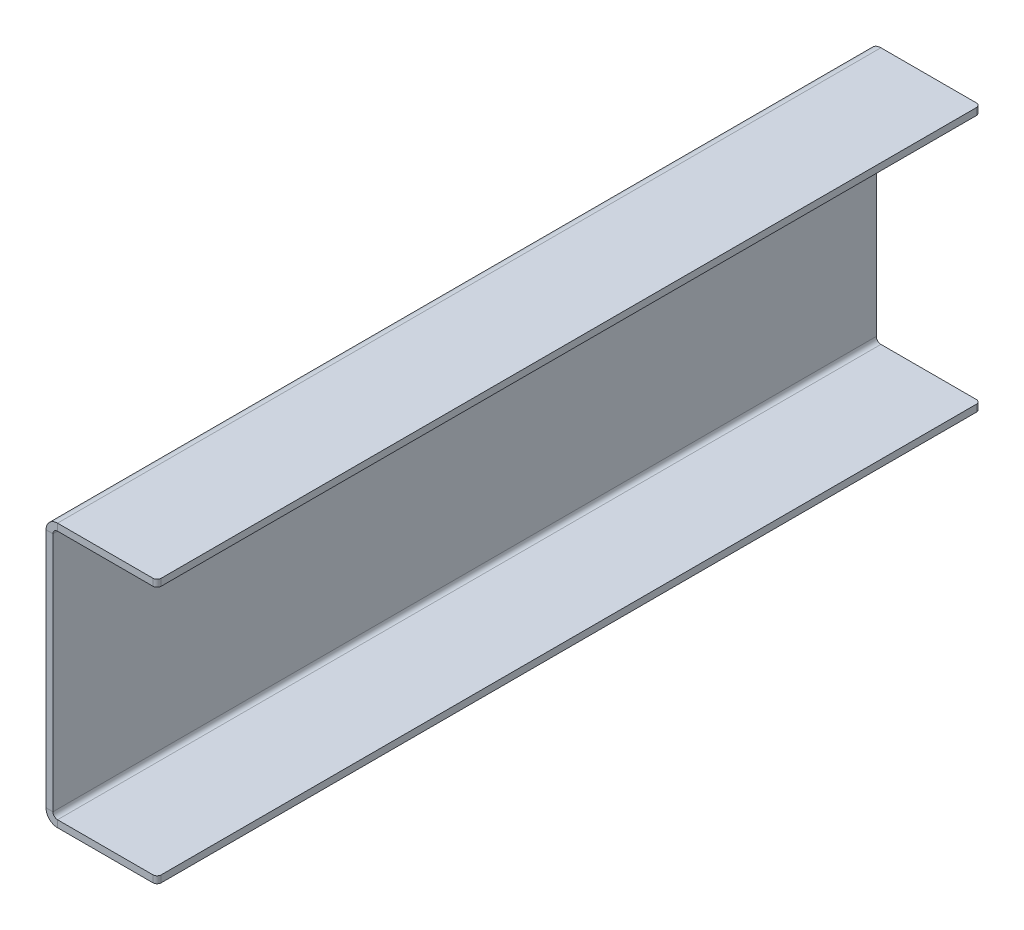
ISO-10303-21;
HEADER;
FILE_DESCRIPTION(('STEP AP214'),'2;1');
FILE_NAME('part.step','',(''),(''),'','','');
FILE_SCHEMA(('AUTOMOTIVE_DESIGN { 1 0 10303 214 1 1 1 1 }'));
ENDSEC;
DATA;
#1=APPLICATION_CONTEXT('core data for automotive mechanical design processes');
#2=APPLICATION_PROTOCOL_DEFINITION('international standard','automotive_design',2000,#1);
#3=PRODUCT_CONTEXT('',#1,'mechanical');
#4=PRODUCT('Part','Part','',(#3));
#5=PRODUCT_RELATED_PRODUCT_CATEGORY('part','',(#4));
#6=PRODUCT_DEFINITION_FORMATION('','',#4);
#7=PRODUCT_DEFINITION_CONTEXT('part definition',#1,'design');
#8=PRODUCT_DEFINITION('design','',#6,#7);
#9=PRODUCT_DEFINITION_SHAPE('','',#8);
#10=(LENGTH_UNIT() NAMED_UNIT(*) SI_UNIT(.MILLI.,.METRE.));
#11=(NAMED_UNIT(*) PLANE_ANGLE_UNIT() SI_UNIT($,.RADIAN.));
#12=(NAMED_UNIT(*) SI_UNIT($,.STERADIAN.) SOLID_ANGLE_UNIT());
#13=UNCERTAINTY_MEASURE_WITH_UNIT(LENGTH_MEASURE(1.E-05),#10,'distance_accuracy_value','');
#14=(GEOMETRIC_REPRESENTATION_CONTEXT(3) GLOBAL_UNCERTAINTY_ASSIGNED_CONTEXT((#13)) GLOBAL_UNIT_ASSIGNED_CONTEXT((#10,
#11,#12)) REPRESENTATION_CONTEXT('',''));
#15=CARTESIAN_POINT('',(0.,0.,0.));
#16=DIRECTION('',(0.,0.,1.));
#17=DIRECTION('',(1.,0.,0.));
#18=AXIS2_PLACEMENT_3D('',#15,#16,#17);
#19=CARTESIAN_POINT('',(-5.,0.,0.));
#20=DIRECTION('',(1.,0.,0.));
#21=DIRECTION('',(0.,0.,-1.));
#22=AXIS2_PLACEMENT_3D('',#19,#20,#21);
#23=PLANE('',#22);
#24=DIRECTION('',(0.,0.,-1.));
#25=VECTOR('',#24,1.);
#26=CARTESIAN_POINT('',(-5.00000000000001,-86.6999999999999,-296.5));
#27=LINE('',#26,#25);
#28=CARTESIAN_POINT('',(-5.00000000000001,-86.6999999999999,-296.5));
#29=VERTEX_POINT('',#28);
#30=CARTESIAN_POINT('',(-5.,-86.7,296.5));
#31=VERTEX_POINT('',#30);
#32=EDGE_CURVE('E160',#29,#31,#27,.F.);
#33=ORIENTED_EDGE('',*,*,#32,.T.);
#34=DIRECTION('',(0.,-1.,0.));
#35=VECTOR('',#34,1.);
#36=CARTESIAN_POINT('',(-5.,-90.,296.5));
#37=LINE('',#36,#35);
#38=CARTESIAN_POINT('',(-5.00000000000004,86.6999999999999,296.5));
#39=VERTEX_POINT('',#38);
#40=EDGE_CURVE('E264',#39,#31,#37,.T.);
#41=ORIENTED_EDGE('',*,*,#40,.F.);
#42=DIRECTION('',(0.,0.,1.));
#43=VECTOR('',#42,1.);
#44=CARTESIAN_POINT('',(-5.00000000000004,86.6999999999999,296.5));
#45=LINE('',#44,#43);
#46=CARTESIAN_POINT('',(-5.,86.7,-296.5));
#47=VERTEX_POINT('',#46);
#48=EDGE_CURVE('E240',#39,#47,#45,.F.);
#49=ORIENTED_EDGE('',*,*,#48,.T.);
#50=DIRECTION('',(0.,1.,0.));
#51=VECTOR('',#50,1.);
#52=CARTESIAN_POINT('',(-5.,-89.9999999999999,-296.5));
#53=LINE('',#52,#51);
#54=EDGE_CURVE('E267',#29,#47,#53,.T.);
#55=ORIENTED_EDGE('',*,*,#54,.F.);
#56=EDGE_LOOP('',(#33,#41,#49,#55));
#57=FACE_BOUND('',#56,.T.);
#58=ADVANCED_FACE('F37',(#57),#23,.F.);
#59=CARTESIAN_POINT('',(0.,0.,0.));
#60=DIRECTION('',(1.,0.,0.));
#61=DIRECTION('',(0.,0.,-1.));
#62=AXIS2_PLACEMENT_3D('',#59,#60,#61);
#63=PLANE('',#62);
#64=DIRECTION('',(0.,-1.,0.));
#65=VECTOR('',#64,1.);
#66=CARTESIAN_POINT('',(0.,-90.,296.5));
#67=LINE('',#66,#65);
#68=CARTESIAN_POINT('',(0.,86.6999999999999,296.5));
#69=VERTEX_POINT('',#68);
#70=CARTESIAN_POINT('',(0.,-86.7,296.5));
#71=VERTEX_POINT('',#70);
#72=EDGE_CURVE('E261',#69,#71,#67,.T.);
#73=ORIENTED_EDGE('',*,*,#72,.T.);
#74=DIRECTION('',(0.,0.,-1.));
#75=VECTOR('',#74,1.);
#76=CARTESIAN_POINT('',(0.,-86.7,-296.5));
#77=LINE('',#76,#75);
#78=CARTESIAN_POINT('',(0.,-86.7,-296.5));
#79=VERTEX_POINT('',#78);
#80=EDGE_CURVE('E207',#79,#71,#77,.F.);
#81=ORIENTED_EDGE('',*,*,#80,.F.);
#82=DIRECTION('',(0.,1.,0.));
#83=VECTOR('',#82,1.);
#84=CARTESIAN_POINT('',(0.,-89.9999999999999,-296.5));
#85=LINE('',#84,#83);
#86=CARTESIAN_POINT('',(0.,86.7,-296.5));
#87=VERTEX_POINT('',#86);
#88=EDGE_CURVE('E268',#79,#87,#85,.T.);
#89=ORIENTED_EDGE('',*,*,#88,.T.);
#90=DIRECTION('',(0.,0.,1.));
#91=VECTOR('',#90,1.);
#92=CARTESIAN_POINT('',(0.,86.7,296.5));
#93=LINE('',#92,#91);
#94=EDGE_CURVE('E253',#69,#87,#93,.F.);
#95=ORIENTED_EDGE('',*,*,#94,.F.);
#96=EDGE_LOOP('',(#73,#81,#89,#95));
#97=FACE_BOUND('',#96,.T.);
#98=ADVANCED_FACE('F324',(#97),#63,.T.);
#99=CARTESIAN_POINT('',(-5.,-89.9999999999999,-296.5));
#100=DIRECTION('',(0.,0.,-1.));
#101=DIRECTION('',(-1.,0.,0.));
#102=AXIS2_PLACEMENT_3D('',#99,#100,#101);
#103=PLANE('',#102);
#104=ORIENTED_EDGE('',*,*,#88,.F.);
#105=DIRECTION('',(-1.,0.,0.));
#106=VECTOR('',#105,1.);
#107=CARTESIAN_POINT('',(0.,-86.7,-296.5));
#108=LINE('',#107,#106);
#109=EDGE_CURVE('E203',#79,#29,#108,.T.);
#110=ORIENTED_EDGE('',*,*,#109,.T.);
#111=ORIENTED_EDGE('',*,*,#54,.T.);
#112=DIRECTION('',(-1.,0.,0.));
#113=VECTOR('',#112,1.);
#114=CARTESIAN_POINT('',(0.,86.7,-296.5));
#115=LINE('',#114,#113);
#116=EDGE_CURVE('E258',#87,#47,#115,.T.);
#117=ORIENTED_EDGE('',*,*,#116,.F.);
#118=EDGE_LOOP('',(#104,#110,#111,#117));
#119=FACE_BOUND('',#118,.T.);
#120=ADVANCED_FACE('F328',(#119),#103,.T.);
#121=CARTESIAN_POINT('',(-5.,-90.,296.5));
#122=DIRECTION('',(0.,0.,1.));
#123=DIRECTION('',(1.,0.,0.));
#124=AXIS2_PLACEMENT_3D('',#121,#122,#123);
#125=PLANE('',#124);
#126=DIRECTION('',(-1.,0.,0.));
#127=VECTOR('',#126,1.);
#128=CARTESIAN_POINT('',(0.,-86.7,296.5));
#129=LINE('',#128,#127);
#130=EDGE_CURVE('E211',#71,#31,#129,.T.);
#131=ORIENTED_EDGE('',*,*,#130,.F.);
#132=ORIENTED_EDGE('',*,*,#72,.F.);
#133=DIRECTION('',(-1.,0.,0.));
#134=VECTOR('',#133,1.);
#135=CARTESIAN_POINT('',(0.,86.7,296.5));
#136=LINE('',#135,#134);
#137=EDGE_CURVE('E247',#69,#39,#136,.T.);
#138=ORIENTED_EDGE('',*,*,#137,.T.);
#139=ORIENTED_EDGE('',*,*,#40,.T.);
#140=EDGE_LOOP('',(#131,#132,#138,#139));
#141=FACE_BOUND('',#140,.T.);
#142=ADVANCED_FACE('F385',(#141),#125,.T.);
#143=CARTESIAN_POINT('',(3.3,86.7,-296.5));
#144=DIRECTION('',(0.,0.,-1.));
#145=DIRECTION('',(-1.,0.,0.));
#146=AXIS2_PLACEMENT_3D('',#143,#144,#145);
#147=PLANE('',#146);
#148=DIRECTION('',(0.,1.,0.));
#149=VECTOR('',#148,1.);
#150=CARTESIAN_POINT('',(3.29999999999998,90.0000000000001,-296.5));
#151=LINE('',#150,#149);
#152=CARTESIAN_POINT('',(3.29999999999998,90.0000000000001,-296.5));
#153=VERTEX_POINT('',#152);
#154=CARTESIAN_POINT('',(3.29999999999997,95.0000000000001,-296.5));
#155=VERTEX_POINT('',#154);
#156=EDGE_CURVE('E214',#153,#155,#151,.T.);
#157=ORIENTED_EDGE('',*,*,#156,.F.);
#158=CARTESIAN_POINT('',(3.3,86.7,-296.5));
#159=DIRECTION('',(0.,0.,1.));
#160=DIRECTION('',(1.,0.,0.));
#161=AXIS2_PLACEMENT_3D('',#158,#159,#160);
#162=CIRCLE('',#161,3.30000000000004);
#163=EDGE_CURVE('E250',#87,#153,#162,.F.);
#164=ORIENTED_EDGE('',*,*,#163,.F.);
#165=ORIENTED_EDGE('',*,*,#116,.T.);
#166=CARTESIAN_POINT('',(3.3,86.7,-296.5));
#167=DIRECTION('',(0.,0.,1.));
#168=DIRECTION('',(1.,0.,0.));
#169=AXIS2_PLACEMENT_3D('',#166,#167,#168);
#170=CIRCLE('',#169,8.30000000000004);
#171=EDGE_CURVE('E243',#47,#155,#170,.F.);
#172=ORIENTED_EDGE('',*,*,#171,.T.);
#173=EDGE_LOOP('',(#157,#164,#165,#172));
#174=FACE_BOUND('',#173,.T.);
#175=ADVANCED_FACE('F337',(#174),#147,.T.);
#176=CARTESIAN_POINT('',(3.3,86.7,296.5));
#177=DIRECTION('',(0.,0.,-1.));
#178=DIRECTION('',(-1.,0.,0.));
#179=AXIS2_PLACEMENT_3D('',#176,#177,#178);
#180=PLANE('',#179);
#181=CARTESIAN_POINT('',(3.3,86.7,296.5));
#182=DIRECTION('',(0.,0.,1.));
#183=DIRECTION('',(1.,0.,0.));
#184=AXIS2_PLACEMENT_3D('',#181,#182,#183);
#185=CIRCLE('',#184,3.30000000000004);
#186=CARTESIAN_POINT('',(3.29999999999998,90.0000000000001,296.5));
#187=VERTEX_POINT('',#186);
#188=EDGE_CURVE('E235',#187,#69,#185,.T.);
#189=ORIENTED_EDGE('',*,*,#188,.F.);
#190=DIRECTION('',(0.,1.,0.));
#191=VECTOR('',#190,1.);
#192=CARTESIAN_POINT('',(3.29999999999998,90.,296.5));
#193=LINE('',#192,#191);
#194=CARTESIAN_POINT('',(3.29999999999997,95.,296.5));
#195=VERTEX_POINT('',#194);
#196=EDGE_CURVE('E219',#187,#195,#193,.T.);
#197=ORIENTED_EDGE('',*,*,#196,.T.);
#198=CARTESIAN_POINT('',(3.3,86.7,296.5));
#199=DIRECTION('',(0.,0.,1.));
#200=DIRECTION('',(1.,0.,0.));
#201=AXIS2_PLACEMENT_3D('',#198,#199,#200);
#202=CIRCLE('',#201,8.30000000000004);
#203=EDGE_CURVE('E244',#195,#39,#202,.T.);
#204=ORIENTED_EDGE('',*,*,#203,.T.);
#205=ORIENTED_EDGE('',*,*,#137,.F.);
#206=EDGE_LOOP('',(#189,#197,#204,#205));
#207=FACE_BOUND('',#206,.T.);
#208=ADVANCED_FACE('F350',(#207),#180,.F.);
#209=CARTESIAN_POINT('',(3.3,86.7,296.5));
#210=DIRECTION('',(0.,0.,1.));
#211=DIRECTION('',(0.,1.,0.));
#212=AXIS2_PLACEMENT_3D('',#209,#210,#211);
#213=CYLINDRICAL_SURFACE('',#212,8.30000000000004);
#214=ORIENTED_EDGE('',*,*,#48,.F.);
#215=ORIENTED_EDGE('',*,*,#203,.F.);
#216=DIRECTION('',(0.,0.,-1.));
#217=VECTOR('',#216,1.);
#218=CARTESIAN_POINT('',(3.29999999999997,95.,0.));
#219=LINE('',#218,#217);
#220=EDGE_CURVE('E222',#195,#155,#219,.T.);
#221=ORIENTED_EDGE('',*,*,#220,.T.);
#222=ORIENTED_EDGE('',*,*,#171,.F.);
#223=EDGE_LOOP('',(#214,#215,#221,#222));
#224=FACE_BOUND('',#223,.T.);
#225=ADVANCED_FACE('F393',(#224),#213,.T.);
#226=CARTESIAN_POINT('',(3.3,86.7,296.5));
#227=DIRECTION('',(0.,0.,1.));
#228=DIRECTION('',(0.,1.,0.));
#229=AXIS2_PLACEMENT_3D('',#226,#227,#228);
#230=CYLINDRICAL_SURFACE('',#229,3.30000000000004);
#231=ORIENTED_EDGE('',*,*,#94,.T.);
#232=ORIENTED_EDGE('',*,*,#163,.T.);
#233=DIRECTION('',(0.,0.,1.));
#234=VECTOR('',#233,1.);
#235=CARTESIAN_POINT('',(3.29999999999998,90.0000000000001,-296.5));
#236=LINE('',#235,#234);
#237=EDGE_CURVE('E217',#153,#187,#236,.T.);
#238=ORIENTED_EDGE('',*,*,#237,.T.);
#239=ORIENTED_EDGE('',*,*,#188,.T.);
#240=EDGE_LOOP('',(#231,#232,#238,#239));
#241=FACE_BOUND('',#240,.T.);
#242=ADVANCED_FACE('F333',(#241),#230,.F.);
#243=CARTESIAN_POINT('',(75.,95.0000000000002,296.5));
#244=DIRECTION('',(0.,0.,-1.));
#245=DIRECTION('',(0.,1.,0.));
#246=AXIS2_PLACEMENT_3D('',#243,#244,#245);
#247=PLANE('',#246);
#248=DIRECTION('',(1.,0.,0.));
#249=VECTOR('',#248,1.);
#250=CARTESIAN_POINT('',(75.,90.0000000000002,296.5));
#251=LINE('',#250,#249);
#252=CARTESIAN_POINT('',(72.,90.0000000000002,296.5));
#253=VERTEX_POINT('',#252);
#254=EDGE_CURVE('E227',#187,#253,#251,.T.);
#255=ORIENTED_EDGE('',*,*,#254,.T.);
#256=DIRECTION('',(0.,-1.,0.));
#257=VECTOR('',#256,1.);
#258=CARTESIAN_POINT('',(72.,95.0000000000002,296.5));
#259=LINE('',#258,#257);
#260=CARTESIAN_POINT('',(72.,95.0000000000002,296.5));
#261=VERTEX_POINT('',#260);
#262=EDGE_CURVE('E11',#253,#261,#259,.F.);
#263=ORIENTED_EDGE('',*,*,#262,.T.);
#264=DIRECTION('',(1.,0.,0.));
#265=VECTOR('',#264,1.);
#266=CARTESIAN_POINT('',(75.,95.0000000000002,296.5));
#267=LINE('',#266,#265);
#268=EDGE_CURVE('E228',#195,#261,#267,.T.);
#269=ORIENTED_EDGE('',*,*,#268,.F.);
#270=ORIENTED_EDGE('',*,*,#196,.F.);
#271=EDGE_LOOP('',(#255,#263,#269,#270));
#272=FACE_BOUND('',#271,.T.);
#273=ADVANCED_FACE('F352',(#272),#247,.F.);
#274=CARTESIAN_POINT('',(0.,95.0000000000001,-296.5));
#275=DIRECTION('',(0.,0.,1.));
#276=DIRECTION('',(0.,-1.,0.));
#277=AXIS2_PLACEMENT_3D('',#274,#275,#276);
#278=PLANE('',#277);
#279=DIRECTION('',(-1.,0.,0.));
#280=VECTOR('',#279,1.);
#281=CARTESIAN_POINT('',(0.,95.0000000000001,-296.5));
#282=LINE('',#281,#280);
#283=CARTESIAN_POINT('',(72.,95.0000000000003,-296.5));
#284=VERTEX_POINT('',#283);
#285=EDGE_CURVE('E233',#284,#155,#282,.T.);
#286=ORIENTED_EDGE('',*,*,#285,.F.);
#287=DIRECTION('',(0.,-1.,0.));
#288=VECTOR('',#287,1.);
#289=CARTESIAN_POINT('',(72.,95.0000000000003,-296.5));
#290=LINE('',#289,#288);
#291=CARTESIAN_POINT('',(72.,90.0000000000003,-296.5));
#292=VERTEX_POINT('',#291);
#293=EDGE_CURVE('E287',#284,#292,#290,.T.);
#294=ORIENTED_EDGE('',*,*,#293,.T.);
#295=DIRECTION('',(-1.,0.,0.));
#296=VECTOR('',#295,1.);
#297=CARTESIAN_POINT('',(0.,90.0000000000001,-296.5));
#298=LINE('',#297,#296);
#299=EDGE_CURVE('E231',#292,#153,#298,.T.);
#300=ORIENTED_EDGE('',*,*,#299,.T.);
#301=ORIENTED_EDGE('',*,*,#156,.T.);
#302=EDGE_LOOP('',(#286,#294,#300,#301));
#303=FACE_BOUND('',#302,.T.);
#304=ADVANCED_FACE('F340',(#303),#278,.F.);
#305=CARTESIAN_POINT('',(-3.33870968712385E-13,95.,0.));
#306=DIRECTION('',(0.,-1.,0.));
#307=DIRECTION('',(1.,0.,0.));
#308=AXIS2_PLACEMENT_3D('',#305,#306,#307);
#309=PLANE('',#308);
#310=DIRECTION('',(0.,0.,-1.));
#311=VECTOR('',#310,1.);
#312=CARTESIAN_POINT('',(75.,95.0000000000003,-296.5));
#313=LINE('',#312,#311);
#314=CARTESIAN_POINT('',(75.,95.0000000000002,293.5));
#315=VERTEX_POINT('',#314);
#316=CARTESIAN_POINT('',(75.,95.0000000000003,-293.5));
#317=VERTEX_POINT('',#316);
#318=EDGE_CURVE('E230',#315,#317,#313,.T.);
#319=ORIENTED_EDGE('',*,*,#318,.T.);
#320=CARTESIAN_POINT('',(72.,95.0000000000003,-293.5));
#321=DIRECTION('',(0.,-1.,0.));
#322=DIRECTION('',(1.,0.,0.));
#323=AXIS2_PLACEMENT_3D('',#320,#321,#322);
#324=CIRCLE('',#323,3.);
#325=EDGE_CURVE('E300',#317,#284,#324,.F.);
#326=ORIENTED_EDGE('',*,*,#325,.T.);
#327=ORIENTED_EDGE('',*,*,#285,.T.);
#328=ORIENTED_EDGE('',*,*,#220,.F.);
#329=ORIENTED_EDGE('',*,*,#268,.T.);
#330=CARTESIAN_POINT('',(72.,95.0000000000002,293.5));
#331=DIRECTION('',(0.,-1.,0.));
#332=DIRECTION('',(1.,0.,0.));
#333=AXIS2_PLACEMENT_3D('',#330,#331,#332);
#334=CIRCLE('',#333,3.);
#335=EDGE_CURVE('E298',#261,#315,#334,.F.);
#336=ORIENTED_EDGE('',*,*,#335,.T.);
#337=EDGE_LOOP('',(#319,#326,#327,#328,#329,#336));
#338=FACE_BOUND('',#337,.T.);
#339=ADVANCED_FACE('F355',(#338),#309,.F.);
#340=CARTESIAN_POINT('',(-3.1641356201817E-13,90.,0.));
#341=DIRECTION('',(0.,-1.,0.));
#342=DIRECTION('',(1.,0.,0.));
#343=AXIS2_PLACEMENT_3D('',#340,#341,#342);
#344=PLANE('',#343);
#345=ORIENTED_EDGE('',*,*,#299,.F.);
#346=CARTESIAN_POINT('',(72.,90.0000000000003,-293.5));
#347=DIRECTION('',(0.,-1.,0.));
#348=DIRECTION('',(1.,0.,0.));
#349=AXIS2_PLACEMENT_3D('',#346,#347,#348);
#350=CIRCLE('',#349,3.);
#351=CARTESIAN_POINT('',(75.,90.0000000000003,-293.5));
#352=VERTEX_POINT('',#351);
#353=EDGE_CURVE('E292',#292,#352,#350,.T.);
#354=ORIENTED_EDGE('',*,*,#353,.T.);
#355=DIRECTION('',(0.,0.,-1.));
#356=VECTOR('',#355,1.);
#357=CARTESIAN_POINT('',(75.,90.0000000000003,-296.5));
#358=LINE('',#357,#356);
#359=CARTESIAN_POINT('',(75.,90.0000000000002,293.5));
#360=VERTEX_POINT('',#359);
#361=EDGE_CURVE('E237',#360,#352,#358,.T.);
#362=ORIENTED_EDGE('',*,*,#361,.F.);
#363=CARTESIAN_POINT('',(72.,90.0000000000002,293.5));
#364=DIRECTION('',(0.,-1.,0.));
#365=DIRECTION('',(1.,0.,0.));
#366=AXIS2_PLACEMENT_3D('',#363,#364,#365);
#367=CIRCLE('',#366,3.);
#368=EDGE_CURVE('E290',#360,#253,#367,.T.);
#369=ORIENTED_EDGE('',*,*,#368,.T.);
#370=ORIENTED_EDGE('',*,*,#254,.F.);
#371=ORIENTED_EDGE('',*,*,#237,.F.);
#372=EDGE_LOOP('',(#345,#354,#362,#369,#370,#371));
#373=FACE_BOUND('',#372,.T.);
#374=ADVANCED_FACE('F344',(#373),#344,.T.);
#375=CARTESIAN_POINT('',(75.,95.0000000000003,-296.5));
#376=DIRECTION('',(-1.,0.,0.));
#377=DIRECTION('',(0.,-1.,0.));
#378=AXIS2_PLACEMENT_3D('',#375,#376,#377);
#379=PLANE('',#378);
#380=ORIENTED_EDGE('',*,*,#361,.T.);
#381=DIRECTION('',(0.,-1.,0.));
#382=VECTOR('',#381,1.);
#383=CARTESIAN_POINT('',(75.,95.0000000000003,-293.5));
#384=LINE('',#383,#382);
#385=EDGE_CURVE('E58',#352,#317,#384,.F.);
#386=ORIENTED_EDGE('',*,*,#385,.T.);
#387=ORIENTED_EDGE('',*,*,#318,.F.);
#388=DIRECTION('',(0.,-1.,0.));
#389=VECTOR('',#388,1.);
#390=CARTESIAN_POINT('',(75.,95.0000000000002,293.5));
#391=LINE('',#390,#389);
#392=EDGE_CURVE('E294',#315,#360,#391,.T.);
#393=ORIENTED_EDGE('',*,*,#392,.T.);
#394=EDGE_LOOP('',(#380,#386,#387,#393));
#395=FACE_BOUND('',#394,.T.);
#396=ADVANCED_FACE('F358',(#395),#379,.F.);
#397=CARTESIAN_POINT('',(3.29999999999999,-86.7,296.5));
#398=DIRECTION('',(0.,0.,1.));
#399=DIRECTION('',(1.,0.,0.));
#400=AXIS2_PLACEMENT_3D('',#397,#398,#399);
#401=PLANE('',#400);
#402=DIRECTION('',(0.,-1.,0.));
#403=VECTOR('',#402,1.);
#404=CARTESIAN_POINT('',(3.29999999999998,-90.,296.5));
#405=LINE('',#404,#403);
#406=CARTESIAN_POINT('',(3.29999999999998,-90.,296.5));
#407=VERTEX_POINT('',#406);
#408=CARTESIAN_POINT('',(3.29999999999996,-95.,296.5));
#409=VERTEX_POINT('',#408);
#410=EDGE_CURVE('E315',#407,#409,#405,.T.);
#411=ORIENTED_EDGE('',*,*,#410,.F.);
#412=CARTESIAN_POINT('',(3.29999999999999,-86.7,296.5));
#413=DIRECTION('',(0.,0.,-1.));
#414=DIRECTION('',(-1.,0.,0.));
#415=AXIS2_PLACEMENT_3D('',#412,#413,#414);
#416=CIRCLE('',#415,3.30000000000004);
#417=EDGE_CURVE('E163',#71,#407,#416,.F.);
#418=ORIENTED_EDGE('',*,*,#417,.F.);
#419=ORIENTED_EDGE('',*,*,#130,.T.);
#420=CARTESIAN_POINT('',(3.29999999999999,-86.7,296.5));
#421=DIRECTION('',(0.,0.,-1.));
#422=DIRECTION('',(-1.,0.,0.));
#423=AXIS2_PLACEMENT_3D('',#420,#421,#422);
#424=CIRCLE('',#423,8.30000000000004);
#425=EDGE_CURVE('E202',#31,#409,#424,.F.);
#426=ORIENTED_EDGE('',*,*,#425,.T.);
#427=EDGE_LOOP('',(#411,#418,#419,#426));
#428=FACE_BOUND('',#427,.T.);
#429=ADVANCED_FACE('F320',(#428),#401,.T.);
#430=CARTESIAN_POINT('',(3.30000000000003,-86.7,-296.5));
#431=DIRECTION('',(0.,0.,1.));
#432=DIRECTION('',(1.,0.,0.));
#433=AXIS2_PLACEMENT_3D('',#430,#431,#432);
#434=PLANE('',#433);
#435=CARTESIAN_POINT('',(3.30000000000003,-86.7,-296.5));
#436=DIRECTION('',(0.,0.,-1.));
#437=DIRECTION('',(-1.,0.,0.));
#438=AXIS2_PLACEMENT_3D('',#435,#436,#437);
#439=CIRCLE('',#438,3.30000000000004);
#440=CARTESIAN_POINT('',(3.30000000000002,-90.,-296.5));
#441=VERTEX_POINT('',#440);
#442=EDGE_CURVE('E170',#441,#79,#439,.T.);
#443=ORIENTED_EDGE('',*,*,#442,.F.);
#444=DIRECTION('',(0.,-1.,0.));
#445=VECTOR('',#444,1.);
#446=CARTESIAN_POINT('',(3.30000000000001,-90.,-296.5));
#447=LINE('',#446,#445);
#448=CARTESIAN_POINT('',(3.29999999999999,-95.,-296.5));
#449=VERTEX_POINT('',#448);
#450=EDGE_CURVE('E167',#441,#449,#447,.T.);
#451=ORIENTED_EDGE('',*,*,#450,.T.);
#452=CARTESIAN_POINT('',(3.30000000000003,-86.7,-296.5));
#453=DIRECTION('',(0.,0.,-1.));
#454=DIRECTION('',(-1.,0.,0.));
#455=AXIS2_PLACEMENT_3D('',#452,#453,#454);
#456=CIRCLE('',#455,8.30000000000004);
#457=EDGE_CURVE('E153',#449,#29,#456,.T.);
#458=ORIENTED_EDGE('',*,*,#457,.T.);
#459=ORIENTED_EDGE('',*,*,#109,.F.);
#460=EDGE_LOOP('',(#443,#451,#458,#459));
#461=FACE_BOUND('',#460,.T.);
#462=ADVANCED_FACE('F168',(#461),#434,.F.);
#463=CARTESIAN_POINT('',(3.30000000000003,-86.7,-296.5));
#464=DIRECTION('',(0.,0.,-1.));
#465=DIRECTION('',(0.,-1.,0.));
#466=AXIS2_PLACEMENT_3D('',#463,#464,#465);
#467=CYLINDRICAL_SURFACE('',#466,8.30000000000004);
#468=ORIENTED_EDGE('',*,*,#32,.F.);
#469=ORIENTED_EDGE('',*,*,#457,.F.);
#470=DIRECTION('',(0.,0.,1.));
#471=VECTOR('',#470,1.);
#472=CARTESIAN_POINT('',(3.29999999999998,-95.,0.));
#473=LINE('',#472,#471);
#474=EDGE_CURVE('E158',#449,#409,#473,.T.);
#475=ORIENTED_EDGE('',*,*,#474,.T.);
#476=ORIENTED_EDGE('',*,*,#425,.F.);
#477=EDGE_LOOP('',(#468,#469,#475,#476));
#478=FACE_BOUND('',#477,.T.);
#479=ADVANCED_FACE('F155',(#478),#467,.T.);
#480=CARTESIAN_POINT('',(3.30000000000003,-86.7,-296.5));
#481=DIRECTION('',(0.,0.,-1.));
#482=DIRECTION('',(0.,-1.,0.));
#483=AXIS2_PLACEMENT_3D('',#480,#481,#482);
#484=CYLINDRICAL_SURFACE('',#483,3.30000000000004);
#485=ORIENTED_EDGE('',*,*,#80,.T.);
#486=ORIENTED_EDGE('',*,*,#417,.T.);
#487=DIRECTION('',(0.,0.,-1.));
#488=VECTOR('',#487,1.);
#489=CARTESIAN_POINT('',(3.29999999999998,-90.,296.5));
#490=LINE('',#489,#488);
#491=EDGE_CURVE('E175',#407,#441,#490,.T.);
#492=ORIENTED_EDGE('',*,*,#491,.T.);
#493=ORIENTED_EDGE('',*,*,#442,.T.);
#494=EDGE_LOOP('',(#485,#486,#492,#493));
#495=FACE_BOUND('',#494,.T.);
#496=ADVANCED_FACE('F321',(#495),#484,.F.);
#497=CARTESIAN_POINT('',(0.,-95.,296.5));
#498=DIRECTION('',(0.,0.,-1.));
#499=DIRECTION('',(0.,1.,0.));
#500=AXIS2_PLACEMENT_3D('',#497,#498,#499);
#501=PLANE('',#500);
#502=DIRECTION('',(-1.,0.,0.));
#503=VECTOR('',#502,1.);
#504=CARTESIAN_POINT('',(0.,-95.,296.5));
#505=LINE('',#504,#503);
#506=CARTESIAN_POINT('',(72.,-95.0000000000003,296.5));
#507=VERTEX_POINT('',#506);
#508=EDGE_CURVE('E183',#507,#409,#505,.T.);
#509=ORIENTED_EDGE('',*,*,#508,.F.);
#510=DIRECTION('',(0.,1.,0.));
#511=VECTOR('',#510,1.);
#512=CARTESIAN_POINT('',(72.,-95.0000000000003,296.5));
#513=LINE('',#512,#511);
#514=CARTESIAN_POINT('',(72.,-90.0000000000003,296.5));
#515=VERTEX_POINT('',#514);
#516=EDGE_CURVE('E45',#507,#515,#513,.T.);
#517=ORIENTED_EDGE('',*,*,#516,.T.);
#518=DIRECTION('',(-1.,0.,0.));
#519=VECTOR('',#518,1.);
#520=CARTESIAN_POINT('',(0.,-90.,296.5));
#521=LINE('',#520,#519);
#522=EDGE_CURVE('E184',#515,#407,#521,.T.);
#523=ORIENTED_EDGE('',*,*,#522,.T.);
#524=ORIENTED_EDGE('',*,*,#410,.T.);
#525=EDGE_LOOP('',(#509,#517,#523,#524));
#526=FACE_BOUND('',#525,.T.);
#527=ADVANCED_FACE('F305',(#526),#501,.F.);
#528=CARTESIAN_POINT('',(75.,-95.0000000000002,-296.5));
#529=DIRECTION('',(0.,0.,1.));
#530=DIRECTION('',(0.,-1.,0.));
#531=AXIS2_PLACEMENT_3D('',#528,#529,#530);
#532=PLANE('',#531);
#533=DIRECTION('',(1.,0.,0.));
#534=VECTOR('',#533,1.);
#535=CARTESIAN_POINT('',(75.,-90.0000000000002,-296.5));
#536=LINE('',#535,#534);
#537=CARTESIAN_POINT('',(72.,-90.0000000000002,-296.5));
#538=VERTEX_POINT('',#537);
#539=EDGE_CURVE('E197',#441,#538,#536,.T.);
#540=ORIENTED_EDGE('',*,*,#539,.T.);
#541=DIRECTION('',(0.,1.,0.));
#542=VECTOR('',#541,1.);
#543=CARTESIAN_POINT('',(72.,-95.0000000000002,-296.5));
#544=LINE('',#543,#542);
#545=CARTESIAN_POINT('',(72.,-95.0000000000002,-296.5));
#546=VERTEX_POINT('',#545);
#547=EDGE_CURVE('E188',#538,#546,#544,.F.);
#548=ORIENTED_EDGE('',*,*,#547,.T.);
#549=DIRECTION('',(1.,0.,0.));
#550=VECTOR('',#549,1.);
#551=CARTESIAN_POINT('',(75.,-95.0000000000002,-296.5));
#552=LINE('',#551,#550);
#553=EDGE_CURVE('E180',#449,#546,#552,.T.);
#554=ORIENTED_EDGE('',*,*,#553,.F.);
#555=ORIENTED_EDGE('',*,*,#450,.F.);
#556=EDGE_LOOP('',(#540,#548,#554,#555));
#557=FACE_BOUND('',#556,.T.);
#558=ADVANCED_FACE('F186',(#557),#532,.F.);
#559=CARTESIAN_POINT('',(-3.33870968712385E-13,-95.,0.));
#560=DIRECTION('',(0.,1.,0.));
#561=DIRECTION('',(-1.,0.,0.));
#562=AXIS2_PLACEMENT_3D('',#559,#560,#561);
#563=PLANE('',#562);
#564=ORIENTED_EDGE('',*,*,#553,.T.);
#565=CARTESIAN_POINT('',(72.,-95.0000000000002,-293.5));
#566=DIRECTION('',(0.,1.,0.));
#567=DIRECTION('',(-1.,0.,0.));
#568=AXIS2_PLACEMENT_3D('',#565,#566,#567);
#569=CIRCLE('',#568,3.);
#570=CARTESIAN_POINT('',(75.,-95.0000000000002,-293.5));
#571=VERTEX_POINT('',#570);
#572=EDGE_CURVE('E285',#546,#571,#569,.F.);
#573=ORIENTED_EDGE('',*,*,#572,.T.);
#574=DIRECTION('',(0.,0.,1.));
#575=VECTOR('',#574,1.);
#576=CARTESIAN_POINT('',(75.,-95.0000000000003,296.5));
#577=LINE('',#576,#575);
#578=CARTESIAN_POINT('',(75.,-95.0000000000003,293.5));
#579=VERTEX_POINT('',#578);
#580=EDGE_CURVE('E189',#571,#579,#577,.T.);
#581=ORIENTED_EDGE('',*,*,#580,.T.);
#582=CARTESIAN_POINT('',(72.,-95.0000000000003,293.5));
#583=DIRECTION('',(0.,1.,0.));
#584=DIRECTION('',(-1.,0.,0.));
#585=AXIS2_PLACEMENT_3D('',#582,#583,#584);
#586=CIRCLE('',#585,3.);
#587=EDGE_CURVE('E283',#579,#507,#586,.F.);
#588=ORIENTED_EDGE('',*,*,#587,.T.);
#589=ORIENTED_EDGE('',*,*,#508,.T.);
#590=ORIENTED_EDGE('',*,*,#474,.F.);
#591=EDGE_LOOP('',(#564,#573,#581,#588,#589,#590));
#592=FACE_BOUND('',#591,.T.);
#593=ADVANCED_FACE('F179',(#592),#563,.F.);
#594=CARTESIAN_POINT('',(-3.16413562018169E-13,-90.,0.));
#595=DIRECTION('',(0.,1.,0.));
#596=DIRECTION('',(-1.,0.,0.));
#597=AXIS2_PLACEMENT_3D('',#594,#595,#596);
#598=PLANE('',#597);
#599=DIRECTION('',(0.,0.,1.));
#600=VECTOR('',#599,1.);
#601=CARTESIAN_POINT('',(75.,-90.0000000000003,296.5));
#602=LINE('',#601,#600);
#603=CARTESIAN_POINT('',(75.,-90.0000000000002,-293.5));
#604=VERTEX_POINT('',#603);
#605=CARTESIAN_POINT('',(75.,-90.0000000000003,293.5));
#606=VERTEX_POINT('',#605);
#607=EDGE_CURVE('E193',#604,#606,#602,.T.);
#608=ORIENTED_EDGE('',*,*,#607,.F.);
#609=CARTESIAN_POINT('',(72.,-90.0000000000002,-293.5));
#610=DIRECTION('',(0.,1.,0.));
#611=DIRECTION('',(-1.,0.,0.));
#612=AXIS2_PLACEMENT_3D('',#609,#610,#611);
#613=CIRCLE('',#612,3.);
#614=EDGE_CURVE('E280',#604,#538,#613,.T.);
#615=ORIENTED_EDGE('',*,*,#614,.T.);
#616=ORIENTED_EDGE('',*,*,#539,.F.);
#617=ORIENTED_EDGE('',*,*,#491,.F.);
#618=ORIENTED_EDGE('',*,*,#522,.F.);
#619=CARTESIAN_POINT('',(72.,-90.0000000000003,293.5));
#620=DIRECTION('',(0.,1.,0.));
#621=DIRECTION('',(-1.,0.,0.));
#622=AXIS2_PLACEMENT_3D('',#619,#620,#621);
#623=CIRCLE('',#622,3.);
#624=EDGE_CURVE('E278',#515,#606,#623,.T.);
#625=ORIENTED_EDGE('',*,*,#624,.T.);
#626=EDGE_LOOP('',(#608,#615,#616,#617,#618,#625));
#627=FACE_BOUND('',#626,.T.);
#628=ADVANCED_FACE('F313',(#627),#598,.T.);
#629=CARTESIAN_POINT('',(75.,-95.0000000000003,296.5));
#630=DIRECTION('',(-1.,0.,0.));
#631=DIRECTION('',(0.,-1.,0.));
#632=AXIS2_PLACEMENT_3D('',#629,#630,#631);
#633=PLANE('',#632);
#634=ORIENTED_EDGE('',*,*,#580,.F.);
#635=DIRECTION('',(0.,1.,0.));
#636=VECTOR('',#635,1.);
#637=CARTESIAN_POINT('',(75.,-95.0000000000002,-293.5));
#638=LINE('',#637,#636);
#639=EDGE_CURVE('E275',#571,#604,#638,.T.);
#640=ORIENTED_EDGE('',*,*,#639,.T.);
#641=ORIENTED_EDGE('',*,*,#607,.T.);
#642=DIRECTION('',(0.,1.,0.));
#643=VECTOR('',#642,1.);
#644=CARTESIAN_POINT('',(75.,-95.0000000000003,293.5));
#645=LINE('',#644,#643);
#646=EDGE_CURVE('E270',#606,#579,#645,.F.);
#647=ORIENTED_EDGE('',*,*,#646,.T.);
#648=EDGE_LOOP('',(#634,#640,#641,#647));
#649=FACE_BOUND('',#648,.T.);
#650=ADVANCED_FACE('F370',(#649),#633,.F.);
#651=CARTESIAN_POINT('',(72.,-95.0000000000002,-293.5));
#652=DIRECTION('',(0.,1.,0.));
#653=DIRECTION('',(-1.,0.,0.));
#654=AXIS2_PLACEMENT_3D('',#651,#652,#653);
#655=CYLINDRICAL_SURFACE('',#654,3.);
#656=ORIENTED_EDGE('',*,*,#572,.F.);
#657=ORIENTED_EDGE('',*,*,#547,.F.);
#658=ORIENTED_EDGE('',*,*,#614,.F.);
#659=ORIENTED_EDGE('',*,*,#639,.F.);
#660=EDGE_LOOP('',(#656,#657,#658,#659));
#661=FACE_BOUND('',#660,.T.);
#662=ADVANCED_FACE('F364',(#661),#655,.T.);
#663=CARTESIAN_POINT('',(72.,95.0000000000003,-293.5));
#664=DIRECTION('',(0.,-1.,0.));
#665=DIRECTION('',(1.,0.,0.));
#666=AXIS2_PLACEMENT_3D('',#663,#664,#665);
#667=CYLINDRICAL_SURFACE('',#666,3.);
#668=ORIENTED_EDGE('',*,*,#325,.F.);
#669=ORIENTED_EDGE('',*,*,#385,.F.);
#670=ORIENTED_EDGE('',*,*,#353,.F.);
#671=ORIENTED_EDGE('',*,*,#293,.F.);
#672=EDGE_LOOP('',(#668,#669,#670,#671));
#673=FACE_BOUND('',#672,.T.);
#674=ADVANCED_FACE('F361',(#673),#667,.T.);
#675=CARTESIAN_POINT('',(72.,-95.0000000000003,293.5));
#676=DIRECTION('',(0.,1.,0.));
#677=DIRECTION('',(-1.,0.,0.));
#678=AXIS2_PLACEMENT_3D('',#675,#676,#677);
#679=CYLINDRICAL_SURFACE('',#678,3.);
#680=ORIENTED_EDGE('',*,*,#587,.F.);
#681=ORIENTED_EDGE('',*,*,#646,.F.);
#682=ORIENTED_EDGE('',*,*,#624,.F.);
#683=ORIENTED_EDGE('',*,*,#516,.F.);
#684=EDGE_LOOP('',(#680,#681,#682,#683));
#685=FACE_BOUND('',#684,.T.);
#686=ADVANCED_FACE('F363',(#685),#679,.T.);
#687=CARTESIAN_POINT('',(72.,95.0000000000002,293.5));
#688=DIRECTION('',(0.,-1.,0.));
#689=DIRECTION('',(1.,0.,0.));
#690=AXIS2_PLACEMENT_3D('',#687,#688,#689);
#691=CYLINDRICAL_SURFACE('',#690,3.);
#692=ORIENTED_EDGE('',*,*,#335,.F.);
#693=ORIENTED_EDGE('',*,*,#262,.F.);
#694=ORIENTED_EDGE('',*,*,#368,.F.);
#695=ORIENTED_EDGE('',*,*,#392,.F.);
#696=EDGE_LOOP('',(#692,#693,#694,#695));
#697=FACE_BOUND('',#696,.T.);
#698=ADVANCED_FACE('F39',(#697),#691,.T.);
#699=CLOSED_SHELL('',(#58,#98,#120,#142,#175,#208,#225,#242,#273,#304,#339,#374,#396,#429,#462,
#479,#496,#527,#558,#593,#628,#650,#662,#674,#686,#698));
#700=MANIFOLD_SOLID_BREP('B2',#699);
#701=ADVANCED_BREP_SHAPE_REPRESENTATION('',(#18,#700),#14);
#702=SHAPE_DEFINITION_REPRESENTATION(#9,#701);
ENDSEC;
END-ISO-10303-21;
